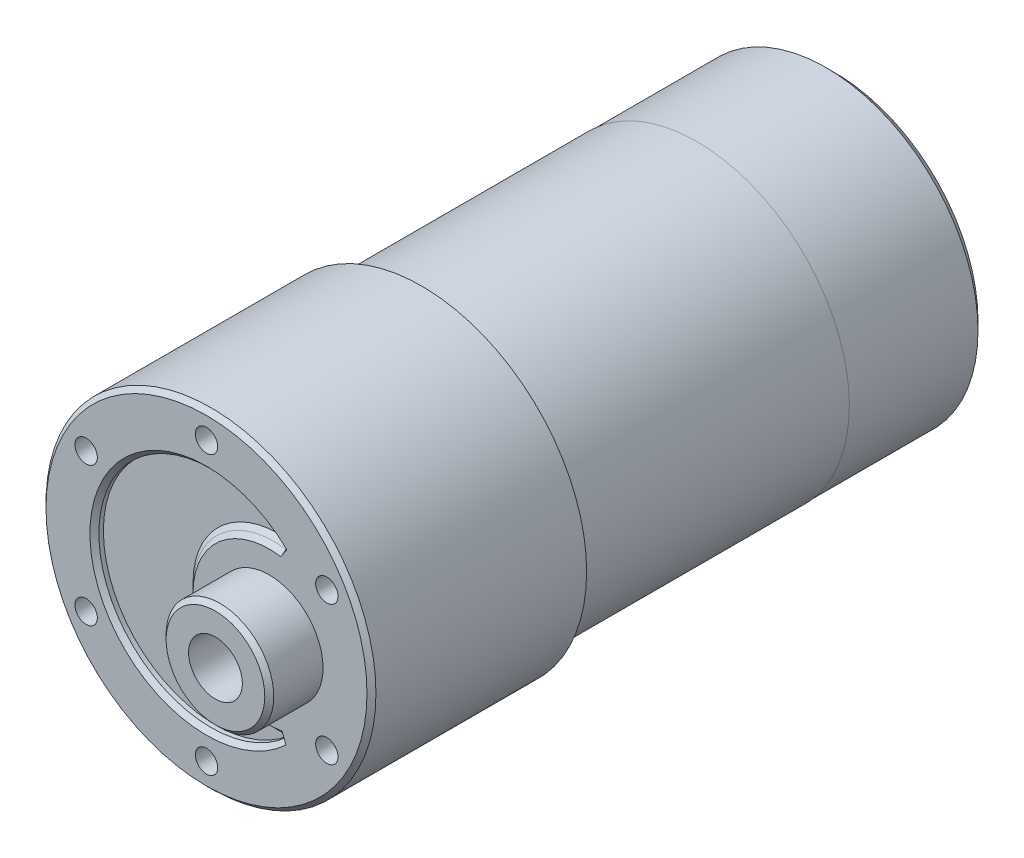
ISO-10303-21;
HEADER;
FILE_DESCRIPTION(('STEP AP214'),'2;1');
FILE_NAME('part.step','',(''),(''),'','','');
FILE_SCHEMA(('AUTOMOTIVE_DESIGN { 1 0 10303 214 1 1 1 1 }'));
ENDSEC;
DATA;
#1=APPLICATION_CONTEXT('core data for automotive mechanical design processes');
#2=APPLICATION_PROTOCOL_DEFINITION('international standard','automotive_design',2000,#1);
#3=PRODUCT_CONTEXT('',#1,'mechanical');
#4=PRODUCT('Part','Part','',(#3));
#5=PRODUCT_RELATED_PRODUCT_CATEGORY('part','',(#4));
#6=PRODUCT_DEFINITION_FORMATION('','',#4);
#7=PRODUCT_DEFINITION_CONTEXT('part definition',#1,'design');
#8=PRODUCT_DEFINITION('design','',#6,#7);
#9=PRODUCT_DEFINITION_SHAPE('','',#8);
#10=(LENGTH_UNIT() NAMED_UNIT(*) SI_UNIT(.MILLI.,.METRE.));
#11=(NAMED_UNIT(*) PLANE_ANGLE_UNIT() SI_UNIT($,.RADIAN.));
#12=(NAMED_UNIT(*) SI_UNIT($,.STERADIAN.) SOLID_ANGLE_UNIT());
#13=UNCERTAINTY_MEASURE_WITH_UNIT(LENGTH_MEASURE(1.E-05),#10,'distance_accuracy_value','');
#14=(GEOMETRIC_REPRESENTATION_CONTEXT(3) GLOBAL_UNCERTAINTY_ASSIGNED_CONTEXT((#13)) GLOBAL_UNIT_ASSIGNED_CONTEXT((#10,
#11,#12)) REPRESENTATION_CONTEXT('',''));
#15=CARTESIAN_POINT('',(0.,0.,0.));
#16=DIRECTION('',(0.,0.,1.));
#17=DIRECTION('',(1.,0.,0.));
#18=AXIS2_PLACEMENT_3D('',#15,#16,#17);
#19=CARTESIAN_POINT('',(0.,0.,30.7));
#20=DIRECTION('',(0.,0.,-1.));
#21=DIRECTION('',(-1.,0.,0.));
#22=AXIS2_PLACEMENT_3D('',#19,#20,#21);
#23=CYLINDRICAL_SURFACE('',#22,17.);
#24=CARTESIAN_POINT('',(0.,0.,29.7));
#25=DIRECTION('',(0.,0.,1.));
#26=DIRECTION('',(1.,0.,0.));
#27=AXIS2_PLACEMENT_3D('',#24,#25,#26);
#28=CIRCLE('',#27,17.);
#29=CARTESIAN_POINT('',(17.,0.,29.7));
#30=VERTEX_POINT('',#29);
#31=EDGE_CURVE('E280',#30,#30,#28,.F.);
#32=ORIENTED_EDGE('',*,*,#31,.T.);
#33=EDGE_LOOP('',(#32));
#34=FACE_BOUND('',#33,.T.);
#35=CARTESIAN_POINT('',(0.,0.,0.));
#36=DIRECTION('',(0.,0.,1.));
#37=DIRECTION('',(1.,0.,0.));
#38=AXIS2_PLACEMENT_3D('',#35,#36,#37);
#39=CIRCLE('',#38,17.);
#40=CARTESIAN_POINT('',(17.,0.,0.));
#41=VERTEX_POINT('',#40);
#42=EDGE_CURVE('E252',#41,#41,#39,.T.);
#43=ORIENTED_EDGE('',*,*,#42,.T.);
#44=EDGE_LOOP('',(#43));
#45=FACE_BOUND('',#44,.T.);
#46=ADVANCED_FACE('F36',(#34,#45),#23,.T.);
#47=CARTESIAN_POINT('',(0.,0.,0.));
#48=DIRECTION('',(0.,0.,1.));
#49=DIRECTION('',(1.,0.,0.));
#50=AXIS2_PLACEMENT_3D('',#47,#48,#49);
#51=PLANE('',#50);
#52=CARTESIAN_POINT('',(0.,0.,0.));
#53=DIRECTION('',(0.,0.,1.));
#54=DIRECTION('',(1.,0.,0.));
#55=AXIS2_PLACEMENT_3D('',#52,#53,#54);
#56=CIRCLE('',#55,16.95);
#57=CARTESIAN_POINT('',(16.95,0.,0.));
#58=VERTEX_POINT('',#57);
#59=EDGE_CURVE('E268',#58,#58,#56,.F.);
#60=ORIENTED_EDGE('',*,*,#59,.F.);
#61=EDGE_LOOP('',(#60));
#62=FACE_BOUND('',#61,.T.);
#63=ORIENTED_EDGE('',*,*,#42,.F.);
#64=EDGE_LOOP('',(#63));
#65=FACE_BOUND('',#64,.T.);
#66=ADVANCED_FACE('F183',(#62,#65),#51,.F.);
#67=CARTESIAN_POINT('',(0.,0.,54.7));
#68=DIRECTION('',(0.,0.,-1.));
#69=DIRECTION('',(-1.,0.,0.));
#70=AXIS2_PLACEMENT_3D('',#67,#68,#69);
#71=CYLINDRICAL_SURFACE('',#70,18.4);
#72=CARTESIAN_POINT('',(0.,0.,54.2));
#73=DIRECTION('',(0.,0.,1.));
#74=DIRECTION('',(1.,0.,0.));
#75=AXIS2_PLACEMENT_3D('',#72,#73,#74);
#76=CIRCLE('',#75,18.4);
#77=CARTESIAN_POINT('',(18.4,0.,54.2));
#78=VERTEX_POINT('',#77);
#79=EDGE_CURVE('E225',#78,#78,#76,.F.);
#80=ORIENTED_EDGE('',*,*,#79,.T.);
#81=EDGE_LOOP('',(#80));
#82=FACE_BOUND('',#81,.T.);
#83=CARTESIAN_POINT('',(0.,0.,30.7));
#84=DIRECTION('',(0.,0.,1.));
#85=DIRECTION('',(1.,0.,0.));
#86=AXIS2_PLACEMENT_3D('',#83,#84,#85);
#87=CIRCLE('',#86,18.4);
#88=CARTESIAN_POINT('',(18.4,0.,30.7));
#89=VERTEX_POINT('',#88);
#90=EDGE_CURVE('E250',#89,#89,#87,.T.);
#91=ORIENTED_EDGE('',*,*,#90,.T.);
#92=EDGE_LOOP('',(#91));
#93=FACE_BOUND('',#92,.T.);
#94=ADVANCED_FACE('F189',(#82,#93),#71,.T.);
#95=CARTESIAN_POINT('',(0.,0.,54.7));
#96=DIRECTION('',(0.,0.,1.));
#97=DIRECTION('',(1.,0.,0.));
#98=AXIS2_PLACEMENT_3D('',#95,#96,#97);
#99=PLANE('',#98);
#100=CARTESIAN_POINT('',(0.,0.,54.7));
#101=DIRECTION('',(0.,0.,1.));
#102=DIRECTION('',(1.,0.,0.));
#103=AXIS2_PLACEMENT_3D('',#100,#101,#102);
#104=CIRCLE('',#103,13.);
#105=CARTESIAN_POINT('',(8.86375710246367,-9.50966929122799,54.7));
#106=VERTEX_POINT('',#105);
#107=CARTESIAN_POINT('',(8.96080829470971,9.41827556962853,54.7));
#108=VERTEX_POINT('',#107);
#109=EDGE_CURVE('E114',#106,#108,#104,.F.);
#110=ORIENTED_EDGE('',*,*,#109,.T.);
#111=CARTESIAN_POINT('',(8.29246640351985,8.40116245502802,54.7));
#112=CARTESIAN_POINT('',(8.35718447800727,8.49965336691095,54.7));
#113=CARTESIAN_POINT('',(8.42190255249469,8.59814427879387,54.7));
#114=CARTESIAN_POINT('',(8.55133870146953,8.79512610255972,54.7));
#115=CARTESIAN_POINT('',(8.61605677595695,8.89361701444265,54.7));
#116=CARTESIAN_POINT('',(8.77411933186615,9.13416380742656,54.7));
#117=CARTESIAN_POINT('',(8.86746381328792,9.27621968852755,54.7));
#118=CARTESIAN_POINT('',(8.96080829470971,9.41827556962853,54.7));
#119=B_SPLINE_CURVE_WITH_KNOTS('',3,(#111,#112,#113,#114,#115,#116,#117,#118),.UNSPECIFIED.,.F.,
.F.,(4,2,2,4),(0.,0.353553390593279,0.707106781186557,1.2170455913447),.UNSPECIFIED.);
#120=CARTESIAN_POINT('',(8.29246640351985,8.40116245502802,54.7));
#121=VERTEX_POINT('',#120);
#122=EDGE_CURVE('E11',#108,#121,#119,.F.);
#123=ORIENTED_EDGE('',*,*,#122,.T.);
#124=CARTESIAN_POINT('',(7.,0.,54.7));
#125=DIRECTION('',(0.,0.,1.));
#126=DIRECTION('',(1.,0.,0.));
#127=AXIS2_PLACEMENT_3D('',#124,#125,#126);
#128=CIRCLE('',#127,8.5);
#129=CARTESIAN_POINT('',(8.43718191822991,-8.37761947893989,54.7));
#130=VERTEX_POINT('',#129);
#131=EDGE_CURVE('E122',#121,#130,#128,.T.);
#132=ORIENTED_EDGE('',*,*,#131,.T.);
#133=CARTESIAN_POINT('',(8.86375710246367,-9.50966929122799,54.7));
#134=CARTESIAN_POINT('',(8.82220122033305,-9.3993878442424,54.7));
#135=CARTESIAN_POINT('',(8.78064533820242,-9.28910639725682,54.7));
#136=CARTESIAN_POINT('',(8.69753357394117,-9.06854350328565,54.7));
#137=CARTESIAN_POINT('',(8.65597769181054,-8.95826205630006,54.7));
#138=CARTESIAN_POINT('',(8.55534184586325,-8.69119356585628,54.7));
#139=CARTESIAN_POINT('',(8.49626188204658,-8.53440652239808,54.7));
#140=CARTESIAN_POINT('',(8.43718191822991,-8.37761947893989,54.7));
#141=B_SPLINE_CURVE_WITH_KNOTS('',3,(#133,#134,#135,#136,#137,#138,#139,#140),.UNSPECIFIED.,.F.,
.F.,(4,2,2,4),(0.,0.353553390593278,0.707106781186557,1.20975334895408),.UNSPECIFIED.);
#142=EDGE_CURVE('E48',#130,#106,#141,.F.);
#143=ORIENTED_EDGE('',*,*,#142,.T.);
#144=EDGE_LOOP('',(#110,#123,#132,#143));
#145=FACE_BOUND('',#144,.T.);
#146=CARTESIAN_POINT('',(0.,0.,54.7));
#147=DIRECTION('',(0.,0.,1.));
#148=DIRECTION('',(1.,0.,0.));
#149=AXIS2_PLACEMENT_3D('',#146,#147,#148);
#150=CIRCLE('',#149,17.9);
#151=CARTESIAN_POINT('',(17.9,0.,54.7));
#152=VERTEX_POINT('',#151);
#153=EDGE_CURVE('E123',#152,#152,#150,.T.);
#154=ORIENTED_EDGE('',*,*,#153,.T.);
#155=EDGE_LOOP('',(#154));
#156=FACE_BOUND('',#155,.T.);
#157=CARTESIAN_POINT('',(13.4233937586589,7.74999999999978,54.7));
#158=DIRECTION('',(0.,0.,1.));
#159=DIRECTION('',(1.,0.,0.));
#160=AXIS2_PLACEMENT_3D('',#157,#158,#159);
#161=CIRCLE('',#160,1.24999999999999);
#162=CARTESIAN_POINT('',(14.6733937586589,7.74999999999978,54.7));
#163=VERTEX_POINT('',#162);
#164=EDGE_CURVE('E353',#163,#163,#161,.T.);
#165=ORIENTED_EDGE('',*,*,#164,.F.);
#166=EDGE_LOOP('',(#165));
#167=FACE_BOUND('',#166,.T.);
#168=CARTESIAN_POINT('',(0.,15.5,54.7));
#169=DIRECTION('',(0.,0.,1.));
#170=DIRECTION('',(1.,0.,0.));
#171=AXIS2_PLACEMENT_3D('',#168,#169,#170);
#172=CIRCLE('',#171,1.24999999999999);
#173=CARTESIAN_POINT('',(1.24999999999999,15.5,54.7));
#174=VERTEX_POINT('',#173);
#175=EDGE_CURVE('E362',#174,#174,#172,.T.);
#176=ORIENTED_EDGE('',*,*,#175,.F.);
#177=EDGE_LOOP('',(#176));
#178=FACE_BOUND('',#177,.T.);
#179=CARTESIAN_POINT('',(13.4233937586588,-7.75000000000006,54.7));
#180=DIRECTION('',(0.,0.,1.));
#181=DIRECTION('',(1.,0.,0.));
#182=AXIS2_PLACEMENT_3D('',#179,#180,#181);
#183=CIRCLE('',#182,1.24999999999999);
#184=CARTESIAN_POINT('',(14.6733937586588,-7.75000000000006,54.7));
#185=VERTEX_POINT('',#184);
#186=EDGE_CURVE('E368',#185,#185,#183,.T.);
#187=ORIENTED_EDGE('',*,*,#186,.F.);
#188=EDGE_LOOP('',(#187));
#189=FACE_BOUND('',#188,.T.);
#190=CARTESIAN_POINT('',(-13.4233937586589,-7.74999999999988,54.7));
#191=DIRECTION('',(0.,0.,1.));
#192=DIRECTION('',(1.,0.,0.));
#193=AXIS2_PLACEMENT_3D('',#190,#191,#192);
#194=CIRCLE('',#193,1.24999999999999);
#195=CARTESIAN_POINT('',(-12.1733937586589,-7.74999999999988,54.7));
#196=VERTEX_POINT('',#195);
#197=EDGE_CURVE('E374',#196,#196,#194,.T.);
#198=ORIENTED_EDGE('',*,*,#197,.F.);
#199=EDGE_LOOP('',(#198));
#200=FACE_BOUND('',#199,.T.);
#201=CARTESIAN_POINT('',(-13.4233937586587,7.75000000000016,54.7));
#202=DIRECTION('',(0.,0.,1.));
#203=DIRECTION('',(1.,0.,0.));
#204=AXIS2_PLACEMENT_3D('',#201,#202,#203);
#205=CIRCLE('',#204,1.24999999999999);
#206=CARTESIAN_POINT('',(-12.1733937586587,7.75000000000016,54.7));
#207=VERTEX_POINT('',#206);
#208=EDGE_CURVE('E380',#207,#207,#205,.T.);
#209=ORIENTED_EDGE('',*,*,#208,.F.);
#210=EDGE_LOOP('',(#209));
#211=FACE_BOUND('',#210,.T.);
#212=CARTESIAN_POINT('',(-1.06692432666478E-13,-15.5,54.7));
#213=DIRECTION('',(0.,0.,1.));
#214=DIRECTION('',(1.,0.,0.));
#215=AXIS2_PLACEMENT_3D('',#212,#213,#214);
#216=CIRCLE('',#215,1.24999999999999);
#217=CARTESIAN_POINT('',(1.24999999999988,-15.5,54.7));
#218=VERTEX_POINT('',#217);
#219=EDGE_CURVE('E386',#218,#218,#216,.T.);
#220=ORIENTED_EDGE('',*,*,#219,.F.);
#221=EDGE_LOOP('',(#220));
#222=FACE_BOUND('',#221,.T.);
#223=CARTESIAN_POINT('',(7.,0.,54.7));
#224=DIRECTION('',(0.,0.,1.));
#225=DIRECTION('',(1.,0.,0.));
#226=AXIS2_PLACEMENT_3D('',#223,#224,#225);
#227=CIRCLE('',#226,6.);
#228=CARTESIAN_POINT('',(13.,0.,54.7));
#229=VERTEX_POINT('',#228);
#230=EDGE_CURVE('E253',#229,#229,#227,.T.);
#231=ORIENTED_EDGE('',*,*,#230,.F.);
#232=EDGE_LOOP('',(#231));
#233=FACE_BOUND('',#232,.T.);
#234=ADVANCED_FACE('F116',(#145,#156,#167,#178,#189,#200,#211,#222,#233),#99,.T.);
#235=CARTESIAN_POINT('',(0.,0.,30.7));
#236=DIRECTION('',(0.,0.,1.));
#237=DIRECTION('',(1.,0.,0.));
#238=AXIS2_PLACEMENT_3D('',#235,#236,#237);
#239=PLANE('',#238);
#240=CARTESIAN_POINT('',(0.,0.,30.7));
#241=DIRECTION('',(0.,0.,1.));
#242=DIRECTION('',(1.,0.,0.));
#243=AXIS2_PLACEMENT_3D('',#240,#241,#242);
#244=CIRCLE('',#243,18.);
#245=CARTESIAN_POINT('',(18.,0.,30.7));
#246=VERTEX_POINT('',#245);
#247=EDGE_CURVE('E277',#246,#246,#244,.T.);
#248=ORIENTED_EDGE('',*,*,#247,.T.);
#249=EDGE_LOOP('',(#248));
#250=FACE_BOUND('',#249,.T.);
#251=ORIENTED_EDGE('',*,*,#90,.F.);
#252=EDGE_LOOP('',(#251));
#253=FACE_BOUND('',#252,.T.);
#254=ADVANCED_FACE('F235',(#250,#253),#239,.F.);
#255=CARTESIAN_POINT('',(7.,0.,60.7));
#256=DIRECTION('',(0.,0.,-1.));
#257=DIRECTION('',(-1.,0.,0.));
#258=AXIS2_PLACEMENT_3D('',#255,#256,#257);
#259=CYLINDRICAL_SURFACE('',#258,6.);
#260=CARTESIAN_POINT('',(7.,0.,60.2));
#261=DIRECTION('',(0.,0.,1.));
#262=DIRECTION('',(1.,0.,0.));
#263=AXIS2_PLACEMENT_3D('',#260,#261,#262);
#264=CIRCLE('',#263,6.);
#265=CARTESIAN_POINT('',(13.,0.,60.2));
#266=VERTEX_POINT('',#265);
#267=EDGE_CURVE('E265',#266,#266,#264,.F.);
#268=ORIENTED_EDGE('',*,*,#267,.T.);
#269=EDGE_LOOP('',(#268));
#270=FACE_BOUND('',#269,.T.);
#271=ORIENTED_EDGE('',*,*,#230,.T.);
#272=EDGE_LOOP('',(#271));
#273=FACE_BOUND('',#272,.T.);
#274=ADVANCED_FACE('F236',(#270,#273),#259,.T.);
#275=CARTESIAN_POINT('',(7.,0.,60.7));
#276=DIRECTION('',(0.,0.,1.));
#277=DIRECTION('',(1.,0.,0.));
#278=AXIS2_PLACEMENT_3D('',#275,#276,#277);
#279=PLANE('',#278);
#280=CARTESIAN_POINT('',(7.,0.,60.7));
#281=DIRECTION('',(0.,0.,1.));
#282=DIRECTION('',(1.,0.,0.));
#283=AXIS2_PLACEMENT_3D('',#280,#281,#282);
#284=CIRCLE('',#283,5.50000000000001);
#285=CARTESIAN_POINT('',(12.5,0.,60.7));
#286=VERTEX_POINT('',#285);
#287=EDGE_CURVE('E256',#286,#286,#284,.T.);
#288=ORIENTED_EDGE('',*,*,#287,.T.);
#289=EDGE_LOOP('',(#288));
#290=FACE_BOUND('',#289,.T.);
#291=CARTESIAN_POINT('',(7.,0.,60.7));
#292=DIRECTION('',(0.,0.,1.));
#293=DIRECTION('',(1.,0.,0.));
#294=AXIS2_PLACEMENT_3D('',#291,#292,#293);
#295=CIRCLE('',#294,3.);
#296=CARTESIAN_POINT('',(10.,0.,60.7));
#297=VERTEX_POINT('',#296);
#298=EDGE_CURVE('E392',#297,#297,#295,.T.);
#299=ORIENTED_EDGE('',*,*,#298,.F.);
#300=EDGE_LOOP('',(#299));
#301=FACE_BOUND('',#300,.T.);
#302=ADVANCED_FACE('F399',(#290,#301),#279,.T.);
#303=CARTESIAN_POINT('',(7.,0.,45.7));
#304=DIRECTION('',(0.,0.,1.));
#305=DIRECTION('',(1.,0.,0.));
#306=AXIS2_PLACEMENT_3D('',#303,#304,#305);
#307=CYLINDRICAL_SURFACE('',#306,3.);
#308=CARTESIAN_POINT('',(7.,0.,45.7));
#309=DIRECTION('',(0.,0.,1.));
#310=DIRECTION('',(1.,0.,0.));
#311=AXIS2_PLACEMENT_3D('',#308,#309,#310);
#312=CIRCLE('',#311,3.);
#313=CARTESIAN_POINT('',(10.,0.,45.7));
#314=VERTEX_POINT('',#313);
#315=EDGE_CURVE('E259',#314,#314,#312,.T.);
#316=ORIENTED_EDGE('',*,*,#315,.F.);
#317=EDGE_LOOP('',(#316));
#318=FACE_BOUND('',#317,.T.);
#319=ORIENTED_EDGE('',*,*,#298,.T.);
#320=EDGE_LOOP('',(#319));
#321=FACE_BOUND('',#320,.T.);
#322=ADVANCED_FACE('F397',(#318,#321),#307,.F.);
#323=CARTESIAN_POINT('',(7.,0.,45.7));
#324=DIRECTION('',(0.,0.,1.));
#325=DIRECTION('',(1.,0.,0.));
#326=AXIS2_PLACEMENT_3D('',#323,#324,#325);
#327=PLANE('',#326);
#328=ORIENTED_EDGE('',*,*,#315,.T.);
#329=EDGE_LOOP('',(#328));
#330=FACE_BOUND('',#329,.T.);
#331=ADVANCED_FACE('F200',(#330),#327,.T.);
#332=CARTESIAN_POINT('',(7.,0.,60.7));
#333=DIRECTION('',(0.,0.,-1.));
#334=DIRECTION('',(-1.,0.,0.));
#335=AXIS2_PLACEMENT_3D('',#332,#333,#334);
#336=CONICAL_SURFACE('',#335,5.50000000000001,0.785398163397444);
#337=ORIENTED_EDGE('',*,*,#267,.F.);
#338=EDGE_LOOP('',(#337));
#339=FACE_BOUND('',#338,.T.);
#340=ORIENTED_EDGE('',*,*,#287,.F.);
#341=EDGE_LOOP('',(#340));
#342=FACE_BOUND('',#341,.T.);
#343=ADVANCED_FACE('F196',(#339,#342),#336,.T.);
#344=CARTESIAN_POINT('',(-1.06692432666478E-13,-15.5,47.7));
#345=DIRECTION('',(0.,0.,1.));
#346=DIRECTION('',(1.,0.,0.));
#347=AXIS2_PLACEMENT_3D('',#344,#345,#346);
#348=CONICAL_SURFACE('',#347,1.25,1.02974425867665);
#349=CARTESIAN_POINT('',(-1.0859089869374E-13,-15.5,46.9489242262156));
#350=VERTEX_POINT('',#349);
#351=VERTEX_LOOP('',#350);
#352=FACE_BOUND('',#351,.T.);
#353=CARTESIAN_POINT('',(-1.06692432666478E-13,-15.5,47.7));
#354=DIRECTION('',(0.,0.,1.));
#355=DIRECTION('',(1.,0.,0.));
#356=AXIS2_PLACEMENT_3D('',#353,#354,#355);
#357=CIRCLE('',#356,1.25);
#358=CARTESIAN_POINT('',(1.24999999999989,-15.5,47.7));
#359=VERTEX_POINT('',#358);
#360=EDGE_CURVE('E389',#359,#359,#357,.T.);
#361=ORIENTED_EDGE('',*,*,#360,.T.);
#362=EDGE_LOOP('',(#361));
#363=FACE_BOUND('',#362,.T.);
#364=ADVANCED_FACE('F199',(#352,#363),#348,.F.);
#365=CARTESIAN_POINT('',(-1.06692432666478E-13,-15.5,54.7));
#366=DIRECTION('',(0.,0.,1.));
#367=DIRECTION('',(1.,0.,0.));
#368=AXIS2_PLACEMENT_3D('',#365,#366,#367);
#369=CYLINDRICAL_SURFACE('',#368,1.24999999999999);
#370=ORIENTED_EDGE('',*,*,#360,.F.);
#371=EDGE_LOOP('',(#370));
#372=FACE_BOUND('',#371,.T.);
#373=ORIENTED_EDGE('',*,*,#219,.T.);
#374=EDGE_LOOP('',(#373));
#375=FACE_BOUND('',#374,.T.);
#376=ADVANCED_FACE('F415',(#372,#375),#369,.F.);
#377=CARTESIAN_POINT('',(-13.4233937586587,7.75000000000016,47.7));
#378=DIRECTION('',(0.,0.,1.));
#379=DIRECTION('',(1.,0.,0.));
#380=AXIS2_PLACEMENT_3D('',#377,#378,#379);
#381=CONICAL_SURFACE('',#380,1.25,1.02974425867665);
#382=CARTESIAN_POINT('',(-13.4233937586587,7.75000000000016,46.9489242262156));
#383=VERTEX_POINT('',#382);
#384=VERTEX_LOOP('',#383);
#385=FACE_BOUND('',#384,.T.);
#386=CARTESIAN_POINT('',(-13.4233937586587,7.75000000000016,47.7));
#387=DIRECTION('',(0.,0.,1.));
#388=DIRECTION('',(1.,0.,0.));
#389=AXIS2_PLACEMENT_3D('',#386,#387,#388);
#390=CIRCLE('',#389,1.25);
#391=CARTESIAN_POINT('',(-12.1733937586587,7.75000000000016,47.7));
#392=VERTEX_POINT('',#391);
#393=EDGE_CURVE('E383',#392,#392,#390,.T.);
#394=ORIENTED_EDGE('',*,*,#393,.T.);
#395=EDGE_LOOP('',(#394));
#396=FACE_BOUND('',#395,.T.);
#397=ADVANCED_FACE('F419',(#385,#396),#381,.F.);
#398=CARTESIAN_POINT('',(-13.4233937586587,7.75000000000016,54.7));
#399=DIRECTION('',(0.,0.,1.));
#400=DIRECTION('',(1.,0.,0.));
#401=AXIS2_PLACEMENT_3D('',#398,#399,#400);
#402=CYLINDRICAL_SURFACE('',#401,1.24999999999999);
#403=ORIENTED_EDGE('',*,*,#393,.F.);
#404=EDGE_LOOP('',(#403));
#405=FACE_BOUND('',#404,.T.);
#406=ORIENTED_EDGE('',*,*,#208,.T.);
#407=EDGE_LOOP('',(#406));
#408=FACE_BOUND('',#407,.T.);
#409=ADVANCED_FACE('F423',(#405,#408),#402,.F.);
#410=CARTESIAN_POINT('',(-13.4233937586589,-7.74999999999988,47.7));
#411=DIRECTION('',(0.,0.,1.));
#412=DIRECTION('',(1.,0.,0.));
#413=AXIS2_PLACEMENT_3D('',#410,#411,#412);
#414=CONICAL_SURFACE('',#413,1.25,1.02974425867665);
#415=CARTESIAN_POINT('',(-13.4233937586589,-7.74999999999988,46.9489242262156));
#416=VERTEX_POINT('',#415);
#417=VERTEX_LOOP('',#416);
#418=FACE_BOUND('',#417,.T.);
#419=CARTESIAN_POINT('',(-13.4233937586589,-7.74999999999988,47.7));
#420=DIRECTION('',(0.,0.,1.));
#421=DIRECTION('',(1.,0.,0.));
#422=AXIS2_PLACEMENT_3D('',#419,#420,#421);
#423=CIRCLE('',#422,1.25);
#424=CARTESIAN_POINT('',(-12.1733937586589,-7.74999999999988,47.7));
#425=VERTEX_POINT('',#424);
#426=EDGE_CURVE('E377',#425,#425,#423,.T.);
#427=ORIENTED_EDGE('',*,*,#426,.T.);
#428=EDGE_LOOP('',(#427));
#429=FACE_BOUND('',#428,.T.);
#430=ADVANCED_FACE('F427',(#418,#429),#414,.F.);
#431=CARTESIAN_POINT('',(-13.4233937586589,-7.74999999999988,54.7));
#432=DIRECTION('',(0.,0.,1.));
#433=DIRECTION('',(1.,0.,0.));
#434=AXIS2_PLACEMENT_3D('',#431,#432,#433);
#435=CYLINDRICAL_SURFACE('',#434,1.24999999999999);
#436=ORIENTED_EDGE('',*,*,#426,.F.);
#437=EDGE_LOOP('',(#436));
#438=FACE_BOUND('',#437,.T.);
#439=ORIENTED_EDGE('',*,*,#197,.T.);
#440=EDGE_LOOP('',(#439));
#441=FACE_BOUND('',#440,.T.);
#442=ADVANCED_FACE('F431',(#438,#441),#435,.F.);
#443=CARTESIAN_POINT('',(13.4233937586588,-7.75000000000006,47.7));
#444=DIRECTION('',(0.,0.,1.));
#445=DIRECTION('',(1.,0.,0.));
#446=AXIS2_PLACEMENT_3D('',#443,#444,#445);
#447=CONICAL_SURFACE('',#446,1.25,1.02974425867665);
#448=CARTESIAN_POINT('',(13.4233937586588,-7.75000000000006,46.9489242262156));
#449=VERTEX_POINT('',#448);
#450=VERTEX_LOOP('',#449);
#451=FACE_BOUND('',#450,.T.);
#452=CARTESIAN_POINT('',(13.4233937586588,-7.75000000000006,47.7));
#453=DIRECTION('',(0.,0.,1.));
#454=DIRECTION('',(1.,0.,0.));
#455=AXIS2_PLACEMENT_3D('',#452,#453,#454);
#456=CIRCLE('',#455,1.25);
#457=CARTESIAN_POINT('',(14.6733937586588,-7.75000000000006,47.7));
#458=VERTEX_POINT('',#457);
#459=EDGE_CURVE('E371',#458,#458,#456,.T.);
#460=ORIENTED_EDGE('',*,*,#459,.T.);
#461=EDGE_LOOP('',(#460));
#462=FACE_BOUND('',#461,.T.);
#463=ADVANCED_FACE('F435',(#451,#462),#447,.F.);
#464=CARTESIAN_POINT('',(13.4233937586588,-7.75000000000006,54.7));
#465=DIRECTION('',(0.,0.,1.));
#466=DIRECTION('',(1.,0.,0.));
#467=AXIS2_PLACEMENT_3D('',#464,#465,#466);
#468=CYLINDRICAL_SURFACE('',#467,1.24999999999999);
#469=ORIENTED_EDGE('',*,*,#459,.F.);
#470=EDGE_LOOP('',(#469));
#471=FACE_BOUND('',#470,.T.);
#472=ORIENTED_EDGE('',*,*,#186,.T.);
#473=EDGE_LOOP('',(#472));
#474=FACE_BOUND('',#473,.T.);
#475=ADVANCED_FACE('F439',(#471,#474),#468,.F.);
#476=CARTESIAN_POINT('',(0.,15.5,47.7));
#477=DIRECTION('',(0.,0.,1.));
#478=DIRECTION('',(1.,0.,0.));
#479=AXIS2_PLACEMENT_3D('',#476,#477,#478);
#480=CONICAL_SURFACE('',#479,1.25,1.02974425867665);
#481=CARTESIAN_POINT('',(0.,15.5,46.9489242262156));
#482=VERTEX_POINT('',#481);
#483=VERTEX_LOOP('',#482);
#484=FACE_BOUND('',#483,.T.);
#485=CARTESIAN_POINT('',(0.,15.5,47.7));
#486=DIRECTION('',(0.,0.,1.));
#487=DIRECTION('',(1.,0.,0.));
#488=AXIS2_PLACEMENT_3D('',#485,#486,#487);
#489=CIRCLE('',#488,1.25);
#490=CARTESIAN_POINT('',(1.25,15.5,47.7));
#491=VERTEX_POINT('',#490);
#492=EDGE_CURVE('E365',#491,#491,#489,.T.);
#493=ORIENTED_EDGE('',*,*,#492,.T.);
#494=EDGE_LOOP('',(#493));
#495=FACE_BOUND('',#494,.T.);
#496=ADVANCED_FACE('F443',(#484,#495),#480,.F.);
#497=CARTESIAN_POINT('',(0.,15.5,54.7));
#498=DIRECTION('',(0.,0.,1.));
#499=DIRECTION('',(1.,0.,0.));
#500=AXIS2_PLACEMENT_3D('',#497,#498,#499);
#501=CYLINDRICAL_SURFACE('',#500,1.24999999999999);
#502=ORIENTED_EDGE('',*,*,#492,.F.);
#503=EDGE_LOOP('',(#502));
#504=FACE_BOUND('',#503,.T.);
#505=ORIENTED_EDGE('',*,*,#175,.T.);
#506=EDGE_LOOP('',(#505));
#507=FACE_BOUND('',#506,.T.);
#508=ADVANCED_FACE('F447',(#504,#507),#501,.F.);
#509=CARTESIAN_POINT('',(13.4233937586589,7.74999999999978,47.7));
#510=DIRECTION('',(0.,0.,1.));
#511=DIRECTION('',(1.,0.,0.));
#512=AXIS2_PLACEMENT_3D('',#509,#510,#511);
#513=CONICAL_SURFACE('',#512,1.25,1.02974425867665);
#514=CARTESIAN_POINT('',(13.4233937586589,7.74999999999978,46.9489242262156));
#515=VERTEX_POINT('',#514);
#516=VERTEX_LOOP('',#515);
#517=FACE_BOUND('',#516,.T.);
#518=CARTESIAN_POINT('',(13.4233937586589,7.74999999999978,47.7));
#519=DIRECTION('',(0.,0.,1.));
#520=DIRECTION('',(1.,0.,0.));
#521=AXIS2_PLACEMENT_3D('',#518,#519,#520);
#522=CIRCLE('',#521,1.25);
#523=CARTESIAN_POINT('',(14.6733937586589,7.74999999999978,47.7));
#524=VERTEX_POINT('',#523);
#525=EDGE_CURVE('E357',#524,#524,#522,.T.);
#526=ORIENTED_EDGE('',*,*,#525,.T.);
#527=EDGE_LOOP('',(#526));
#528=FACE_BOUND('',#527,.T.);
#529=ADVANCED_FACE('F450',(#517,#528),#513,.F.);
#530=CARTESIAN_POINT('',(13.4233937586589,7.74999999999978,54.7));
#531=DIRECTION('',(0.,0.,1.));
#532=DIRECTION('',(1.,0.,0.));
#533=AXIS2_PLACEMENT_3D('',#530,#531,#532);
#534=CYLINDRICAL_SURFACE('',#533,1.24999999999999);
#535=ORIENTED_EDGE('',*,*,#525,.F.);
#536=EDGE_LOOP('',(#535));
#537=FACE_BOUND('',#536,.T.);
#538=ORIENTED_EDGE('',*,*,#164,.T.);
#539=EDGE_LOOP('',(#538));
#540=FACE_BOUND('',#539,.T.);
#541=ADVANCED_FACE('F299',(#537,#540),#534,.F.);
#542=CARTESIAN_POINT('',(0.,0.,53.7));
#543=DIRECTION('',(0.,0.,1.));
#544=DIRECTION('',(1.,0.,0.));
#545=AXIS2_PLACEMENT_3D('',#542,#543,#544);
#546=CYLINDRICAL_SURFACE('',#545,12.5);
#547=DIRECTION('',(0.,0.,1.));
#548=VECTOR('',#547,1.);
#549=CARTESIAN_POINT('',(8.52284336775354,-9.14391278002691,53.7));
#550=LINE('',#549,#548);
#551=CARTESIAN_POINT('',(8.52284336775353,-9.14391278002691,54.2));
#552=VERTEX_POINT('',#551);
#553=CARTESIAN_POINT('',(8.52284336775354,-9.14391278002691,53.9301460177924));
#554=VERTEX_POINT('',#553);
#555=EDGE_CURVE('E291',#552,#554,#550,.F.);
#556=ORIENTED_EDGE('',*,*,#555,.T.);
#557=CARTESIAN_POINT('',(8.52284336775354,-9.14391278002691,53.9301460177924));
#558=CARTESIAN_POINT('',(8.47215467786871,-9.19115749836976,53.8918681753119));
#559=CARTESIAN_POINT('',(8.42109719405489,-9.23796010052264,53.853550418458));
#560=CARTESIAN_POINT('',(8.31824464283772,-9.33068106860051,53.7768350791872));
#561=CARTESIAN_POINT('',(8.26644957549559,-9.37659943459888,53.738437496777));
#562=CARTESIAN_POINT('',(8.21428571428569,-9.42207568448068,53.7));
#563=B_SPLINE_CURVE_WITH_KNOTS('',3,(#557,#558,#559,#560,#561,#562),.UNSPECIFIED.,.F.,.F.,(4,2,
4),(0.,0.237466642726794,0.474933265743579),.UNSPECIFIED.);
#564=CARTESIAN_POINT('',(8.21428571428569,-9.42207568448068,53.7));
#565=VERTEX_POINT('',#564);
#566=EDGE_CURVE('E304',#554,#565,#563,.T.);
#567=ORIENTED_EDGE('',*,*,#566,.T.);
#568=CARTESIAN_POINT('',(0.,0.,53.7));
#569=DIRECTION('',(0.,0.,1.));
#570=DIRECTION('',(1.,0.,0.));
#571=AXIS2_PLACEMENT_3D('',#568,#569,#570);
#572=CIRCLE('',#571,12.5);
#573=CARTESIAN_POINT('',(8.21428571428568,9.42207568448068,53.7));
#574=VERTEX_POINT('',#573);
#575=EDGE_CURVE('E352',#574,#565,#572,.T.);
#576=ORIENTED_EDGE('',*,*,#575,.F.);
#577=CARTESIAN_POINT('',(8.21428571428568,9.42207568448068,53.7));
#578=CARTESIAN_POINT('',(8.28253334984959,9.36257849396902,53.7502899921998));
#579=CARTESIAN_POINT('',(8.35014684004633,9.30232644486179,53.8005086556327));
#580=CARTESIAN_POINT('',(8.48410554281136,9.18031261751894,53.9008033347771));
#581=CARTESIAN_POINT('',(8.55045075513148,9.11855083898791,53.9508793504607));
#582=CARTESIAN_POINT('',(8.61616182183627,9.05603420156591,54.0008840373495));
#583=B_SPLINE_CURVE_WITH_KNOTS('',3,(#577,#578,#579,#580,#581,#582),.UNSPECIFIED.,.F.,.F.,(4,2,
4),(0.,0.31066745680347,0.621334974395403),.UNSPECIFIED.);
#584=CARTESIAN_POINT('',(8.61616182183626,9.0560342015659,54.0008840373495));
#585=VERTEX_POINT('',#584);
#586=EDGE_CURVE('E285',#574,#585,#583,.T.);
#587=ORIENTED_EDGE('',*,*,#586,.T.);
#588=DIRECTION('',(0.,0.,1.));
#589=VECTOR('',#588,1.);
#590=CARTESIAN_POINT('',(8.61616182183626,9.0560342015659,53.7));
#591=LINE('',#590,#589);
#592=CARTESIAN_POINT('',(8.61616182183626,9.0560342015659,54.2));
#593=VERTEX_POINT('',#592);
#594=EDGE_CURVE('E283',#585,#593,#591,.T.);
#595=ORIENTED_EDGE('',*,*,#594,.T.);
#596=CARTESIAN_POINT('',(0.,0.,54.2));
#597=DIRECTION('',(0.,0.,1.));
#598=DIRECTION('',(1.,0.,0.));
#599=AXIS2_PLACEMENT_3D('',#596,#597,#598);
#600=CIRCLE('',#599,12.5);
#601=EDGE_CURVE('E131',#593,#552,#600,.T.);
#602=ORIENTED_EDGE('',*,*,#601,.T.);
#603=EDGE_LOOP('',(#556,#567,#576,#587,#595,#602));
#604=FACE_BOUND('',#603,.T.);
#605=ADVANCED_FACE('F293',(#604),#546,.F.);
#606=CARTESIAN_POINT('',(3.5,0.,53.7));
#607=DIRECTION('',(0.,0.,1.));
#608=DIRECTION('',(1.,0.,0.));
#609=AXIS2_PLACEMENT_3D('',#606,#607,#608);
#610=PLANE('',#609);
#611=ORIENTED_EDGE('',*,*,#575,.T.);
#612=CARTESIAN_POINT('',(7.,0.,53.7));
#613=DIRECTION('',(0.,0.,1.));
#614=DIRECTION('',(1.,0.,0.));
#615=AXIS2_PLACEMENT_3D('',#612,#613,#614);
#616=CIRCLE('',#615,9.50000000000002);
#617=EDGE_CURVE('E309',#565,#574,#616,.F.);
#618=ORIENTED_EDGE('',*,*,#617,.T.);
#619=EDGE_LOOP('',(#611,#618));
#620=FACE_BOUND('',#619,.T.);
#621=ADVANCED_FACE('F298',(#620),#610,.T.);
#622=CARTESIAN_POINT('',(0.,0.,-15.4));
#623=DIRECTION('',(0.,0.,1.));
#624=DIRECTION('',(1.,0.,0.));
#625=AXIS2_PLACEMENT_3D('',#622,#623,#624);
#626=CYLINDRICAL_SURFACE('',#625,16.95);
#627=CARTESIAN_POINT('',(0.,0.,-14.4));
#628=DIRECTION('',(0.,0.,-1.));
#629=DIRECTION('',(-1.,0.,0.));
#630=AXIS2_PLACEMENT_3D('',#627,#628,#629);
#631=CIRCLE('',#630,16.95);
#632=CARTESIAN_POINT('',(16.95,0.,-14.4));
#633=VERTEX_POINT('',#632);
#634=EDGE_CURVE('E274',#633,#633,#631,.F.);
#635=CARTESIAN_POINT('',(16.95,0.,-14.4));
#636=CARTESIAN_POINT('',(16.95,0.,-14.25));
#637=CARTESIAN_POINT('',(16.95,0.,-14.1));
#638=CARTESIAN_POINT('',(16.95,0.,-13.8));
#639=CARTESIAN_POINT('',(16.95,0.,-13.65));
#640=CARTESIAN_POINT('',(16.95,0.,-13.35));
#641=CARTESIAN_POINT('',(16.95,0.,-13.2));
#642=CARTESIAN_POINT('',(16.95,0.,-12.9));
#643=CARTESIAN_POINT('',(16.95,0.,-12.75));
#644=CARTESIAN_POINT('',(16.95,0.,-12.45));
#645=CARTESIAN_POINT('',(16.95,0.,-12.3));
#646=CARTESIAN_POINT('',(16.95,0.,-12.));
#647=CARTESIAN_POINT('',(16.95,0.,-11.85));
#648=CARTESIAN_POINT('',(16.95,0.,-11.55));
#649=CARTESIAN_POINT('',(16.95,0.,-11.4));
#650=CARTESIAN_POINT('',(16.95,0.,-11.1));
#651=CARTESIAN_POINT('',(16.95,0.,-10.95));
#652=CARTESIAN_POINT('',(16.95,0.,-10.65));
#653=CARTESIAN_POINT('',(16.95,0.,-10.5));
#654=CARTESIAN_POINT('',(16.95,0.,-10.2));
#655=CARTESIAN_POINT('',(16.95,0.,-10.05));
#656=CARTESIAN_POINT('',(16.95,0.,-9.75000000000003));
#657=CARTESIAN_POINT('',(16.95,0.,-9.60000000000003));
#658=CARTESIAN_POINT('',(16.95,0.,-9.30000000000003));
#659=CARTESIAN_POINT('',(16.95,0.,-9.15000000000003));
#660=CARTESIAN_POINT('',(16.95,0.,-8.85000000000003));
#661=CARTESIAN_POINT('',(16.95,0.,-8.70000000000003));
#662=CARTESIAN_POINT('',(16.95,0.,-8.40000000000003));
#663=CARTESIAN_POINT('',(16.95,0.,-8.25000000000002));
#664=CARTESIAN_POINT('',(16.95,0.,-7.95000000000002));
#665=CARTESIAN_POINT('',(16.95,0.,-7.80000000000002));
#666=CARTESIAN_POINT('',(16.95,0.,-7.50000000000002));
#667=CARTESIAN_POINT('',(16.95,0.,-7.35000000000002));
#668=CARTESIAN_POINT('',(16.95,0.,-7.05000000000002));
#669=CARTESIAN_POINT('',(16.95,0.,-6.90000000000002));
#670=CARTESIAN_POINT('',(16.95,0.,-6.60000000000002));
#671=CARTESIAN_POINT('',(16.95,0.,-6.45000000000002));
#672=CARTESIAN_POINT('',(16.95,0.,-6.15000000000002));
#673=CARTESIAN_POINT('',(16.95,0.,-6.00000000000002));
#674=CARTESIAN_POINT('',(16.95,0.,-5.70000000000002));
#675=CARTESIAN_POINT('',(16.95,0.,-5.55000000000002));
#676=CARTESIAN_POINT('',(16.95,0.,-5.25000000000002));
#677=CARTESIAN_POINT('',(16.95,0.,-5.10000000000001));
#678=CARTESIAN_POINT('',(16.95,0.,-4.80000000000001));
#679=CARTESIAN_POINT('',(16.95,0.,-4.65000000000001));
#680=CARTESIAN_POINT('',(16.95,0.,-4.35000000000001));
#681=CARTESIAN_POINT('',(16.95,0.,-4.20000000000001));
#682=CARTESIAN_POINT('',(16.95,0.,-3.90000000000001));
#683=CARTESIAN_POINT('',(16.95,0.,-3.75000000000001));
#684=CARTESIAN_POINT('',(16.95,0.,-3.45000000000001));
#685=CARTESIAN_POINT('',(16.95,0.,-3.30000000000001));
#686=CARTESIAN_POINT('',(16.95,0.,-3.00000000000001));
#687=CARTESIAN_POINT('',(16.95,0.,-2.85000000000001));
#688=CARTESIAN_POINT('',(16.95,0.,-2.55000000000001));
#689=CARTESIAN_POINT('',(16.95,0.,-2.40000000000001));
#690=CARTESIAN_POINT('',(16.95,0.,-2.10000000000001));
#691=CARTESIAN_POINT('',(16.95,0.,-1.95000000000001));
#692=CARTESIAN_POINT('',(16.95,0.,-1.65000000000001));
#693=CARTESIAN_POINT('',(16.95,0.,-1.50000000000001));
#694=CARTESIAN_POINT('',(16.95,0.,-1.20000000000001));
#695=CARTESIAN_POINT('',(16.95,0.,-1.05000000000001));
#696=CARTESIAN_POINT('',(16.95,0.,-0.750000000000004));
#697=CARTESIAN_POINT('',(16.95,0.,-0.600000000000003));
#698=CARTESIAN_POINT('',(16.95,0.,-0.300000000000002));
#699=CARTESIAN_POINT('',(16.95,0.,-0.150000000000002));
#700=CARTESIAN_POINT('',(16.95,0.,0.));
#701=B_SPLINE_CURVE_WITH_KNOTS('',3,(#635,#636,#637,#638,#639,#640,#641,#642,#643,#644,#645,
#646,#647,#648,#649,#650,#651,#652,#653,#654,#655,#656,#657,#658,#659,#660,#661,#662,#663,#664,
#665,#666,#667,#668,#669,#670,#671,#672,#673,#674,#675,#676,#677,#678,#679,#680,#681,#682,#683,
#684,#685,#686,#687,#688,#689,#690,#691,#692,#693,#694,#695,#696,#697,#698,#699,#700),
.UNSPECIFIED.,.F.,.F.,(4,2,2,2,2,2,2,2,2,2,2,2,2,2,2,2,2,2,2,2,2,2,2,2,2,2,2,2,2,2,2,2,4),(0.,
0.450000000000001,0.900000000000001,1.35,1.8,2.25000000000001,2.70000000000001,3.15000000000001,
3.60000000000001,4.05000000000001,4.50000000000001,4.95000000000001,5.40000000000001,
5.85000000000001,6.30000000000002,6.75000000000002,7.20000000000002,7.65000000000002,
8.10000000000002,8.55000000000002,9.00000000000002,9.45000000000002,9.90000000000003,10.35,10.8,
11.25,11.7,12.15,12.6,13.05,13.5,13.95,14.4),.UNSPECIFIED.);
#702=EDGE_CURVE('BSEAM495',#633,#58,#701,.T.);
#703=ORIENTED_EDGE('',*,*,#634,.T.);
#704=ORIENTED_EDGE('',*,*,#59,.T.);
#705=ORIENTED_EDGE('',*,*,#702,.T.);
#706=ORIENTED_EDGE('',*,*,#702,.F.);
#707=EDGE_LOOP('',(#703,#705,#704,#706));
#708=FACE_BOUND('',#707,.T.);
#709=ADVANCED_FACE('F495',(#708),#626,.T.);
#710=CARTESIAN_POINT('',(0.,0.,-15.4));
#711=DIRECTION('',(0.,0.,-1.));
#712=DIRECTION('',(-1.,0.,0.));
#713=AXIS2_PLACEMENT_3D('',#710,#711,#712);
#714=PLANE('',#713);
#715=CARTESIAN_POINT('',(0.,0.,-15.4));
#716=DIRECTION('',(0.,0.,-1.));
#717=DIRECTION('',(-1.,0.,0.));
#718=AXIS2_PLACEMENT_3D('',#715,#716,#717);
#719=CIRCLE('',#718,15.95);
#720=CARTESIAN_POINT('',(-15.95,0.,-15.4));
#721=VERTEX_POINT('',#720);
#722=EDGE_CURVE('E271',#721,#721,#719,.T.);
#723=ORIENTED_EDGE('',*,*,#722,.T.);
#724=EDGE_LOOP('',(#723));
#725=FACE_BOUND('',#724,.T.);
#726=ADVANCED_FACE('F203',(#725),#714,.T.);
#727=CARTESIAN_POINT('',(0.,0.,-15.4));
#728=DIRECTION('',(0.,0.,1.));
#729=DIRECTION('',(1.,0.,0.));
#730=AXIS2_PLACEMENT_3D('',#727,#728,#729);
#731=CONICAL_SURFACE('',#730,15.95,0.785398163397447);
#732=ORIENTED_EDGE('',*,*,#634,.F.);
#733=EDGE_LOOP('',(#732));
#734=FACE_BOUND('',#733,.T.);
#735=ORIENTED_EDGE('',*,*,#722,.F.);
#736=EDGE_LOOP('',(#735));
#737=FACE_BOUND('',#736,.T.);
#738=ADVANCED_FACE('F179',(#734,#737),#731,.T.);
#739=CARTESIAN_POINT('',(0.,0.,29.7));
#740=DIRECTION('',(0.,0.,1.));
#741=DIRECTION('',(1.,0.,0.));
#742=AXIS2_PLACEMENT_3D('',#739,#740,#741);
#743=TOROIDAL_SURFACE('',#742,18.,1.);
#744=ORIENTED_EDGE('',*,*,#31,.F.);
#745=EDGE_LOOP('',(#744));
#746=FACE_BOUND('',#745,.T.);
#747=ORIENTED_EDGE('',*,*,#247,.F.);
#748=EDGE_LOOP('',(#747));
#749=FACE_BOUND('',#748,.T.);
#750=ADVANCED_FACE('F170',(#746,#749),#743,.F.);
#751=CARTESIAN_POINT('',(8.36849383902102,8.89534848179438,54.2));
#752=CARTESIAN_POINT('',(8.61616182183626,9.0560342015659,54.2));
#753=CARTESIAN_POINT('',(8.29246640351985,8.40116245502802,54.7));
#754=CARTESIAN_POINT('',(8.96080829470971,9.41827556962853,54.7));
#755=B_SPLINE_SURFACE_WITH_KNOTS('',1,1,((#751,#752),(#753,#754)),.UNSPECIFIED.,.F.,.F.,.F.,(2,
2),(2,2),(0.,1.),(0.,1.),.UNSPECIFIED.);
#756=DIRECTION('',(-0.487403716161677,-0.512286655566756,-0.707106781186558));
#757=VECTOR('',#756,1.);
#758=CARTESIAN_POINT('',(8.96080829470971,9.41827556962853,54.7));
#759=LINE('',#758,#757);
#760=EDGE_CURVE('E126',#593,#108,#759,.F.);
#761=CARTESIAN_POINT('',(8.61616182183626,9.0560342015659,54.2));
#762=CARTESIAN_POINT('',(8.36849383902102,8.89534848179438,54.2));
#763=B_SPLINE_CURVE_WITH_KNOTS('',1,(#761,#762),.UNSPECIFIED.,.F.,.F.,(2,2),(0.,1.),.UNSPECIFIED.);
#764=CARTESIAN_POINT('',(8.36849383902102,8.89534848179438,54.2));
#765=VERTEX_POINT('',#764);
#766=EDGE_CURVE('E40',#765,#593,#763,.F.);
#767=DIRECTION('',(-0.107519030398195,-0.698884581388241,0.707106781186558));
#768=VECTOR('',#767,1.);
#769=CARTESIAN_POINT('',(8.36849383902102,8.89534848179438,54.2));
#770=LINE('',#769,#768);
#771=EDGE_CURVE('E128',#121,#765,#770,.F.);
#772=ORIENTED_EDGE('',*,*,#760,.F.);
#773=ORIENTED_EDGE('',*,*,#766,.F.);
#774=ORIENTED_EDGE('',*,*,#771,.F.);
#775=ORIENTED_EDGE('',*,*,#122,.F.);
#776=EDGE_LOOP('',(#772,#773,#774,#775));
#777=FACE_BOUND('',#776,.T.);
#778=ADVANCED_FACE('F125',(#777),#755,.T.);
#779=CARTESIAN_POINT('',(8.61616182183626,9.0560342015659,53.7));
#780=DIRECTION('',(0.544277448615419,-0.838905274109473,0.));
#781=DIRECTION('',(0.,0.,1.));
#782=AXIS2_PLACEMENT_3D('',#779,#780,#781);
#783=PLANE('',#782);
#784=ORIENTED_EDGE('',*,*,#766,.T.);
#785=ORIENTED_EDGE('',*,*,#594,.F.);
#786=CARTESIAN_POINT('',(8.61616182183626,9.0560342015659,54.0008840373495));
#787=CARTESIAN_POINT('',(8.57505304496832,9.02936303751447,54.0343691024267));
#788=CARTESIAN_POINT('',(8.5338596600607,9.0026369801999,54.0677046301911));
#789=CARTESIAN_POINT('',(8.45130366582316,8.94907507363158,54.1340766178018));
#790=CARTESIAN_POINT('',(8.40994105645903,8.92223922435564,54.1671130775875));
#791=CARTESIAN_POINT('',(8.36849383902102,8.89534848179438,54.2));
#792=B_SPLINE_CURVE_WITH_KNOTS('',3,(#786,#787,#788,#789,#790,#791),.UNSPECIFIED.,.F.,.F.,(4,2,
4),(0.,0.178050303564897,0.356100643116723),.UNSPECIFIED.);
#793=EDGE_CURVE('E132',#765,#585,#792,.F.);
#794=ORIENTED_EDGE('',*,*,#793,.F.);
#795=EDGE_LOOP('',(#784,#785,#794));
#796=FACE_BOUND('',#795,.T.);
#797=ADVANCED_FACE('F147',(#796),#783,.F.);
#798=CARTESIAN_POINT('',(7.,0.,54.2));
#799=DIRECTION('',(0.,0.,-1.));
#800=DIRECTION('',(-1.,0.,0.));
#801=AXIS2_PLACEMENT_3D('',#798,#799,#800);
#802=CONICAL_SURFACE('',#801,9.,0.785398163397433);
#803=ORIENTED_EDGE('',*,*,#131,.F.);
#804=ORIENTED_EDGE('',*,*,#771,.T.);
#805=CARTESIAN_POINT('',(7.,0.,54.2));
#806=DIRECTION('',(0.,0.,1.));
#807=DIRECTION('',(1.,0.,0.));
#808=AXIS2_PLACEMENT_3D('',#805,#806,#807);
#809=CIRCLE('',#808,9.);
#810=CARTESIAN_POINT('',(8.52172203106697,-8.87042062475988,54.2));
#811=VERTEX_POINT('',#810);
#812=EDGE_CURVE('E66',#811,#765,#809,.F.);
#813=ORIENTED_EDGE('',*,*,#812,.F.);
#814=DIRECTION('',(0.119557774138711,-0.696926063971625,-0.707106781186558));
#815=VECTOR('',#814,1.);
#816=CARTESIAN_POINT('',(8.43718191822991,-8.37761947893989,54.7));
#817=LINE('',#816,#815);
#818=EDGE_CURVE('E313',#130,#811,#817,.T.);
#819=ORIENTED_EDGE('',*,*,#818,.F.);
#820=EDGE_LOOP('',(#803,#804,#813,#819));
#821=FACE_BOUND('',#820,.T.);
#822=ADVANCED_FACE('F151',(#821),#802,.T.);
#823=CARTESIAN_POINT('',(0.,0.,54.2));
#824=DIRECTION('',(0.,0.,1.));
#825=DIRECTION('',(1.,0.,0.));
#826=AXIS2_PLACEMENT_3D('',#823,#824,#825);
#827=CONICAL_SURFACE('',#826,12.5,0.785398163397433);
#828=ORIENTED_EDGE('',*,*,#760,.T.);
#829=ORIENTED_EDGE('',*,*,#109,.F.);
#830=DIRECTION('',(0.482124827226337,-0.517257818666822,0.707106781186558));
#831=VECTOR('',#830,1.);
#832=CARTESIAN_POINT('',(8.52284336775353,-9.14391278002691,54.2));
#833=LINE('',#832,#831);
#834=EDGE_CURVE('E316',#552,#106,#833,.T.);
#835=ORIENTED_EDGE('',*,*,#834,.F.);
#836=ORIENTED_EDGE('',*,*,#601,.F.);
#837=EDGE_LOOP('',(#828,#829,#835,#836));
#838=FACE_BOUND('',#837,.T.);
#839=ADVANCED_FACE('F130',(#838),#827,.F.);
#840=CARTESIAN_POINT('',(7.,0.,53.7));
#841=DIRECTION('',(0.,0.,-1.));
#842=DIRECTION('',(-1.,0.,0.));
#843=AXIS2_PLACEMENT_3D('',#840,#841,#842);
#844=CONICAL_SURFACE('',#843,9.50000000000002,0.785398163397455);
#845=ORIENTED_EDGE('',*,*,#617,.F.);
#846=ORIENTED_EDGE('',*,*,#566,.F.);
#847=CARTESIAN_POINT('',(8.52284336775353,-9.14391278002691,53.9301460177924));
#848=CARTESIAN_POINT('',(8.52265651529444,-9.09833977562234,53.9751308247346));
#849=CARTESIAN_POINT('',(8.52246964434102,-9.05276226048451,54.0201110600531));
#850=CARTESIAN_POINT('',(8.5220958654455,-8.96159820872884,54.1100623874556));
#851=CARTESIAN_POINT('',(8.52190895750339,-8.91601167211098,54.1550334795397));
#852=CARTESIAN_POINT('',(8.52172203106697,-8.87042062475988,54.2));
#853=B_SPLINE_CURVE_WITH_KNOTS('',3,(#847,#848,#849,#850,#851,#852),.UNSPECIFIED.,.F.,.F.,(4,2,
4),(0.,0.192106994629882,0.384213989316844),.UNSPECIFIED.);
#854=EDGE_CURVE('E317',#811,#554,#853,.F.);
#855=ORIENTED_EDGE('',*,*,#854,.F.);
#856=ORIENTED_EDGE('',*,*,#812,.T.);
#857=ORIENTED_EDGE('',*,*,#793,.T.);
#858=ORIENTED_EDGE('',*,*,#586,.F.);
#859=EDGE_LOOP('',(#845,#846,#855,#856,#857,#858));
#860=FACE_BOUND('',#859,.T.);
#861=ADVANCED_FACE('F143',(#860),#844,.T.);
#862=CARTESIAN_POINT('',(8.52284336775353,-9.14391278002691,54.2));
#863=CARTESIAN_POINT('',(8.52172203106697,-8.87042062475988,54.2));
#864=CARTESIAN_POINT('',(8.86375710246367,-9.50966929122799,54.7));
#865=CARTESIAN_POINT('',(8.43718191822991,-8.37761947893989,54.7));
#866=B_SPLINE_SURFACE_WITH_KNOTS('',1,1,((#862,#863),(#864,#865)),.UNSPECIFIED.,.F.,.F.,.F.,(2,
2),(2,2),(0.,1.),(0.,1.),.UNSPECIFIED.);
#867=CARTESIAN_POINT('',(8.52172203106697,-8.87042062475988,54.2));
#868=CARTESIAN_POINT('',(8.52284336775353,-9.14391278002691,54.2));
#869=B_SPLINE_CURVE_WITH_KNOTS('',1,(#867,#868),.UNSPECIFIED.,.F.,.F.,(2,2),(0.,1.),.UNSPECIFIED.);
#870=EDGE_CURVE('E323',#552,#811,#869,.F.);
#871=ORIENTED_EDGE('',*,*,#142,.F.);
#872=ORIENTED_EDGE('',*,*,#818,.T.);
#873=ORIENTED_EDGE('',*,*,#870,.F.);
#874=ORIENTED_EDGE('',*,*,#834,.T.);
#875=EDGE_LOOP('',(#871,#872,#873,#874));
#876=FACE_BOUND('',#875,.T.);
#877=ADVANCED_FACE('F153',(#876),#866,.T.);
#878=CARTESIAN_POINT('',(8.52172203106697,-8.87042062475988,53.7));
#879=DIRECTION('',(0.999991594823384,0.00410003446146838,0.));
#880=DIRECTION('',(0.,0.,1.));
#881=AXIS2_PLACEMENT_3D('',#878,#879,#880);
#882=PLANE('',#881);
#883=ORIENTED_EDGE('',*,*,#854,.T.);
#884=ORIENTED_EDGE('',*,*,#555,.F.);
#885=ORIENTED_EDGE('',*,*,#870,.T.);
#886=EDGE_LOOP('',(#883,#884,#885));
#887=FACE_BOUND('',#886,.T.);
#888=ADVANCED_FACE('F325',(#887),#882,.F.);
#889=CARTESIAN_POINT('',(0.,0.,54.7));
#890=DIRECTION('',(0.,0.,-1.));
#891=DIRECTION('',(-1.,0.,0.));
#892=AXIS2_PLACEMENT_3D('',#889,#890,#891);
#893=CONICAL_SURFACE('',#892,17.9,0.785398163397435);
#894=ORIENTED_EDGE('',*,*,#79,.F.);
#895=EDGE_LOOP('',(#894));
#896=FACE_BOUND('',#895,.T.);
#897=ORIENTED_EDGE('',*,*,#153,.F.);
#898=EDGE_LOOP('',(#897));
#899=FACE_BOUND('',#898,.T.);
#900=ADVANCED_FACE('F38',(#896,#899),#893,.T.);
#901=CLOSED_SHELL('',(#46,#66,#94,#234,#254,#274,#302,#322,#331,#343,#364,#376,#397,#409,#430,
#442,#463,#475,#496,#508,#529,#541,#605,#621,#709,#726,#738,#750,#778,#797,#822,#839,#861,#877,
#888,#900));
#902=MANIFOLD_SOLID_BREP('B2',#901);
#903=ADVANCED_BREP_SHAPE_REPRESENTATION('',(#18,#902),#14);
#904=SHAPE_DEFINITION_REPRESENTATION(#9,#903);
ENDSEC;
END-ISO-10303-21;
